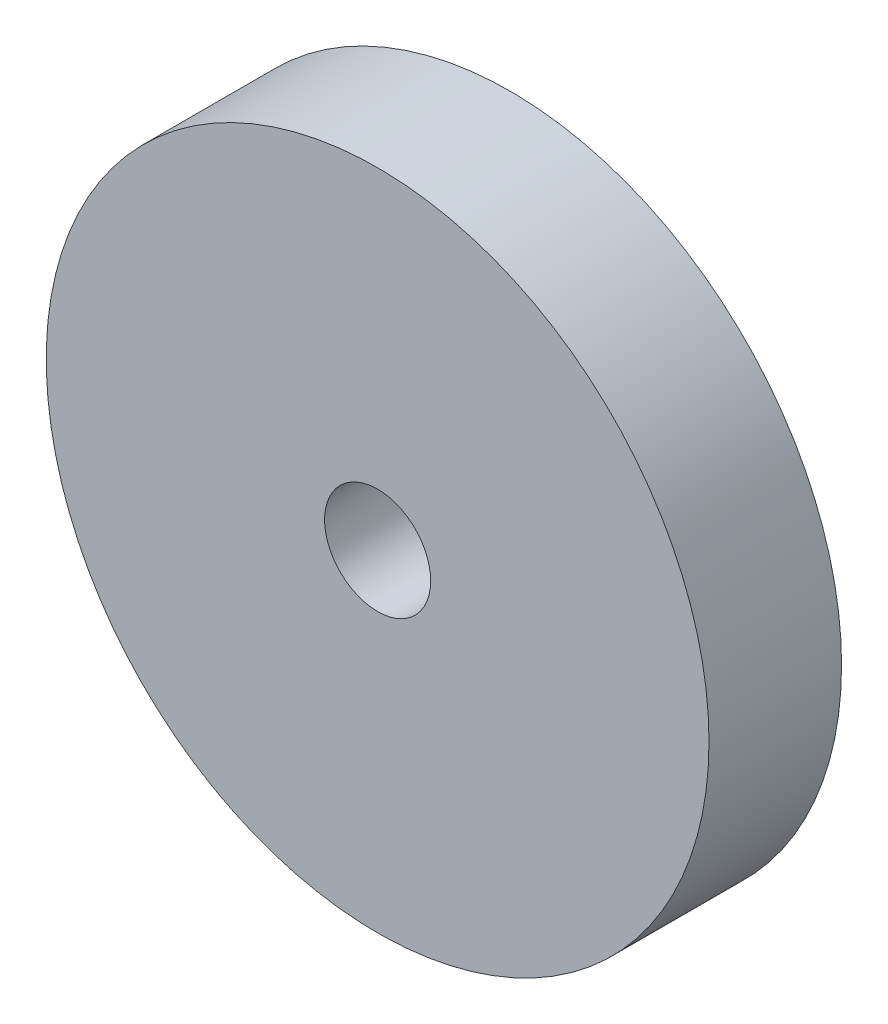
ISO-10303-21;
HEADER;
FILE_DESCRIPTION(('STEP AP214'),'2;1');
FILE_NAME('part.step','',(''),(''),'','','');
FILE_SCHEMA(('AUTOMOTIVE_DESIGN { 1 0 10303 214 1 1 1 1 }'));
ENDSEC;
DATA;
#1=APPLICATION_CONTEXT('core data for automotive mechanical design processes');
#2=APPLICATION_PROTOCOL_DEFINITION('international standard','automotive_design',2000,#1);
#3=PRODUCT_CONTEXT('',#1,'mechanical');
#4=PRODUCT('Part','Part','',(#3));
#5=PRODUCT_RELATED_PRODUCT_CATEGORY('part','',(#4));
#6=PRODUCT_DEFINITION_FORMATION('','',#4);
#7=PRODUCT_DEFINITION_CONTEXT('part definition',#1,'design');
#8=PRODUCT_DEFINITION('design','',#6,#7);
#9=PRODUCT_DEFINITION_SHAPE('','',#8);
#10=(LENGTH_UNIT() NAMED_UNIT(*) SI_UNIT(.MILLI.,.METRE.));
#11=(NAMED_UNIT(*) PLANE_ANGLE_UNIT() SI_UNIT($,.RADIAN.));
#12=(NAMED_UNIT(*) SI_UNIT($,.STERADIAN.) SOLID_ANGLE_UNIT());
#13=UNCERTAINTY_MEASURE_WITH_UNIT(LENGTH_MEASURE(1.E-05),#10,'distance_accuracy_value','');
#14=(GEOMETRIC_REPRESENTATION_CONTEXT(3) GLOBAL_UNCERTAINTY_ASSIGNED_CONTEXT((#13)) GLOBAL_UNIT_ASSIGNED_CONTEXT((#10,
#11,#12)) REPRESENTATION_CONTEXT('',''));
#15=CARTESIAN_POINT('',(0.,0.,0.));
#16=DIRECTION('',(0.,0.,1.));
#17=DIRECTION('',(1.,0.,0.));
#18=AXIS2_PLACEMENT_3D('',#15,#16,#17);
#19=CARTESIAN_POINT('',(0.,0.,10.));
#20=DIRECTION('',(0.,0.,1.));
#21=DIRECTION('',(1.,0.,0.));
#22=AXIS2_PLACEMENT_3D('',#19,#20,#21);
#23=PLANE('',#22);
#24=CARTESIAN_POINT('',(0.,0.,10.));
#25=DIRECTION('',(0.,0.,1.));
#26=DIRECTION('',(1.,0.,0.));
#27=AXIS2_PLACEMENT_3D('',#24,#25,#26);
#28=CIRCLE('',#27,25.);
#29=CARTESIAN_POINT('',(25.,0.,10.));
#30=VERTEX_POINT('',#29);
#31=EDGE_CURVE('E10',#30,#30,#28,.T.);
#32=ORIENTED_EDGE('',*,*,#31,.T.);
#33=EDGE_LOOP('',(#32));
#34=FACE_BOUND('',#33,.T.);
#35=CARTESIAN_POINT('',(0.,0.,10.));
#36=DIRECTION('',(0.,0.,1.));
#37=DIRECTION('',(1.,0.,0.));
#38=AXIS2_PLACEMENT_3D('',#35,#36,#37);
#39=CIRCLE('',#38,4.);
#40=CARTESIAN_POINT('',(4.,0.,10.));
#41=VERTEX_POINT('',#40);
#42=EDGE_CURVE('E45',#41,#41,#39,.T.);
#43=ORIENTED_EDGE('',*,*,#42,.F.);
#44=EDGE_LOOP('',(#43));
#45=FACE_BOUND('',#44,.T.);
#46=ADVANCED_FACE('F34',(#34,#45),#23,.T.);
#47=CARTESIAN_POINT('',(0.,0.,0.));
#48=DIRECTION('',(0.,0.,1.));
#49=DIRECTION('',(1.,0.,0.));
#50=AXIS2_PLACEMENT_3D('',#47,#48,#49);
#51=PLANE('',#50);
#52=CARTESIAN_POINT('',(0.,0.,0.));
#53=DIRECTION('',(0.,0.,1.));
#54=DIRECTION('',(1.,0.,0.));
#55=AXIS2_PLACEMENT_3D('',#52,#53,#54);
#56=CIRCLE('',#55,25.);
#57=CARTESIAN_POINT('',(25.,0.,0.));
#58=VERTEX_POINT('',#57);
#59=EDGE_CURVE('E38',#58,#58,#56,.T.);
#60=ORIENTED_EDGE('',*,*,#59,.F.);
#61=EDGE_LOOP('',(#60));
#62=FACE_BOUND('',#61,.T.);
#63=CARTESIAN_POINT('',(0.,0.,0.));
#64=DIRECTION('',(0.,0.,1.));
#65=DIRECTION('',(1.,0.,0.));
#66=AXIS2_PLACEMENT_3D('',#63,#64,#65);
#67=CIRCLE('',#66,4.);
#68=CARTESIAN_POINT('',(4.,0.,0.));
#69=VERTEX_POINT('',#68);
#70=EDGE_CURVE('E47',#69,#69,#67,.T.);
#71=ORIENTED_EDGE('',*,*,#70,.T.);
#72=EDGE_LOOP('',(#71));
#73=FACE_BOUND('',#72,.T.);
#74=ADVANCED_FACE('F57',(#62,#73),#51,.F.);
#75=CARTESIAN_POINT('',(0.,0.,10.));
#76=DIRECTION('',(0.,0.,-1.));
#77=DIRECTION('',(-1.,0.,0.));
#78=AXIS2_PLACEMENT_3D('',#75,#76,#77);
#79=CYLINDRICAL_SURFACE('',#78,25.);
#80=ORIENTED_EDGE('',*,*,#31,.F.);
#81=EDGE_LOOP('',(#80));
#82=FACE_BOUND('',#81,.T.);
#83=ORIENTED_EDGE('',*,*,#59,.T.);
#84=EDGE_LOOP('',(#83));
#85=FACE_BOUND('',#84,.T.);
#86=ADVANCED_FACE('F36',(#82,#85),#79,.T.);
#87=CARTESIAN_POINT('',(0.,0.,10.));
#88=DIRECTION('',(0.,0.,-1.));
#89=DIRECTION('',(-1.,0.,0.));
#90=AXIS2_PLACEMENT_3D('',#87,#88,#89);
#91=CYLINDRICAL_SURFACE('',#90,4.);
#92=ORIENTED_EDGE('',*,*,#42,.T.);
#93=EDGE_LOOP('',(#92));
#94=FACE_BOUND('',#93,.T.);
#95=ORIENTED_EDGE('',*,*,#70,.F.);
#96=EDGE_LOOP('',(#95));
#97=FACE_BOUND('',#96,.T.);
#98=ADVANCED_FACE('F53',(#94,#97),#91,.F.);
#99=CLOSED_SHELL('',(#46,#74,#86,#98));
#100=MANIFOLD_SOLID_BREP('B2',#99);
#101=ADVANCED_BREP_SHAPE_REPRESENTATION('',(#18,#100),#14);
#102=SHAPE_DEFINITION_REPRESENTATION(#9,#101);
ENDSEC;
END-ISO-10303-21;
